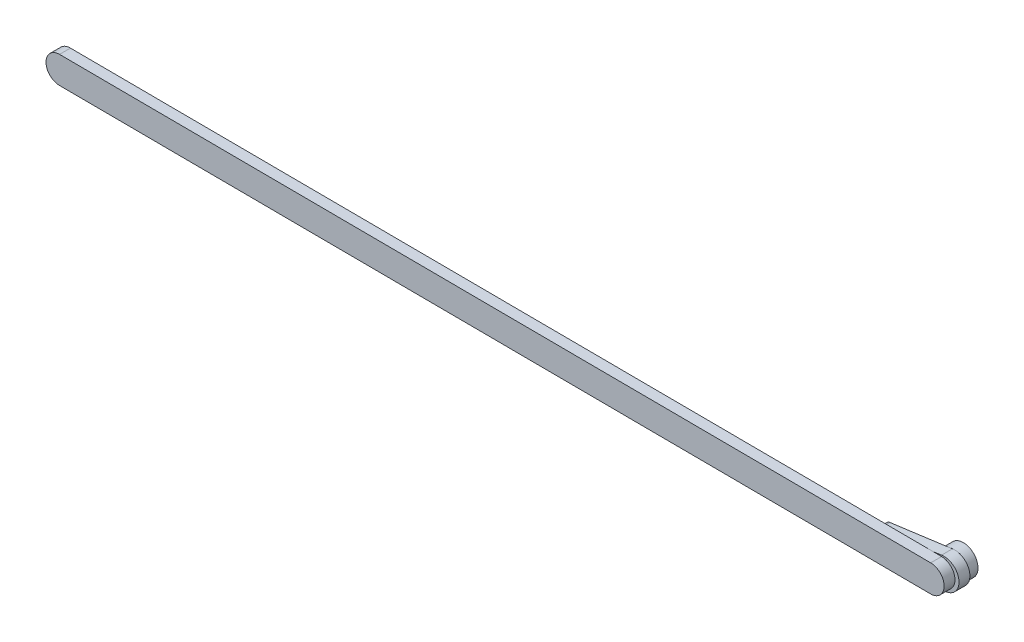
from build123d import *

# Parameters (mm, degrees)
SKETCH2_R           = 1.7145
BOSS_EXTRUDE1_DEPTH = 1.27
BOSS_EXTRUDE2_DEPTH = 1.27
BOSS_EXTRUDE3_DEPTH = 1.27


with BuildPart() as part:
    # Sketch2 → Boss-Extrude1 (new body)
    with BuildSketch(Plane.XY):
        Circle(SKETCH2_R)
    extrude(amount=BOSS_EXTRUDE1_DEPTH)

    # Sketch3 → Boss-Extrude2 (add)
    with BuildSketch(Plane.XY.offset(1.27)):
        with BuildLine():
            Line((0, 1.7145), (-7.296622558, 0.732501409))
            ThreePointArc((-7.296622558, 0.732501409), (-7.814299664, 0.098921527), (-7.216734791, -0.459942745))
            Line((-7.216734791, -0.459942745), (0, -1.7145))
            ThreePointArc((0, -1.7145), (2.038262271, 0), (0, 1.7145))
        make_face()
    extrude(amount=BOSS_EXTRUDE2_DEPTH)

    # Sketch4 → Boss-Extrude3 (add)
    with BuildSketch(Plane.XY.offset(2.54)):
        with BuildLine():
            Line((-0.008634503, -1.572945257), (-101.608634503, -1.015223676))
            ThreePointArc((-101.608634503, -1.015223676), (-103.172945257, 0.566356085), (-101.591365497, 2.130666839))
            Line((-101.591365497, 2.130666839), (0.008634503, 1.572945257))
            ThreePointArc((0.008634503, 1.572945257), (1.572945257, -0.008634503), (-0.008634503, -1.572945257))
        make_face()
    extrude(amount=BOSS_EXTRUDE3_DEPTH)


solid = part.part
